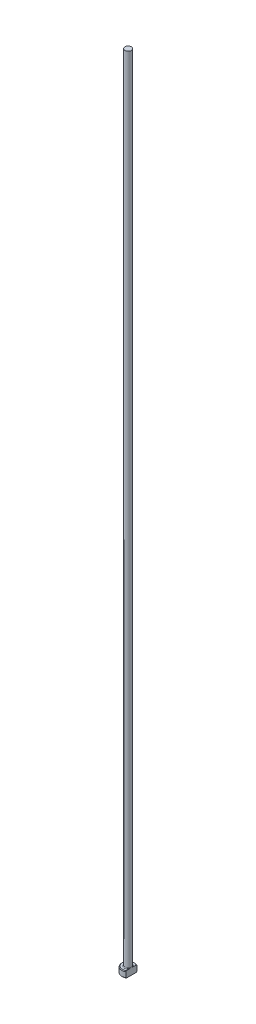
from build123d import *
from build123d.topology import SkipClean

# Parameters (mm, degrees)
CHAMFER1_SIZE = 0.2
FILLET1_R     = 0.2
KEY_DEPTH     = 251.015999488


with BuildPart() as part:
    # Sketch1 → Revolve1 (revolve)
    with BuildSketch(Plane.XY, mode=Mode.PRIVATE) as revolve1_sk:
        Polygon((0, 0), (-2, 0), (-2, 2), (-1, 2), (-1, 250), (0, 250), align=None)
    revolve(revolve1_sk.sketch.rotate(Axis((0, 259.958771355, 0), (0, -1, 0)), 270), axis=Axis((0, 259.958771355, 0), (0, -1, 0)))

    # Chamfer1
    chamfer1_edges = [part.edges().sort_by_distance(p)[0] for p in [
        (0, 2, -2),
        (0, 0, -2),
    ]]
    chamfer(chamfer1_edges, length=CHAMFER1_SIZE)

    # Fillet1
    fillet1_edges = [part.edges().sort_by_distance(p)[0] for p in [
        (0, 2, -1),
    ]]
    fillet(fillet1_edges, radius=FILLET1_R)

    # Sketch2 → KEY (cut, through all)
    with SkipClean():  # the faces are left unmerged after this step: merging them gives an invalid solid
        with BuildSketch(Plane(origin=(0, 0, 0), x_dir=(1, 0, 0), z_dir=(0, 1, 0))):
            with BuildLine():
                Line((1, 1.732050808), (1, -1.732050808))
                ThreePointArc((1, -1.732050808), (2, 0), (1, 1.732050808))
            make_face()
        extrude(amount=KEY_DEPTH, mode=Mode.SUBTRACT)


solid = part.part
